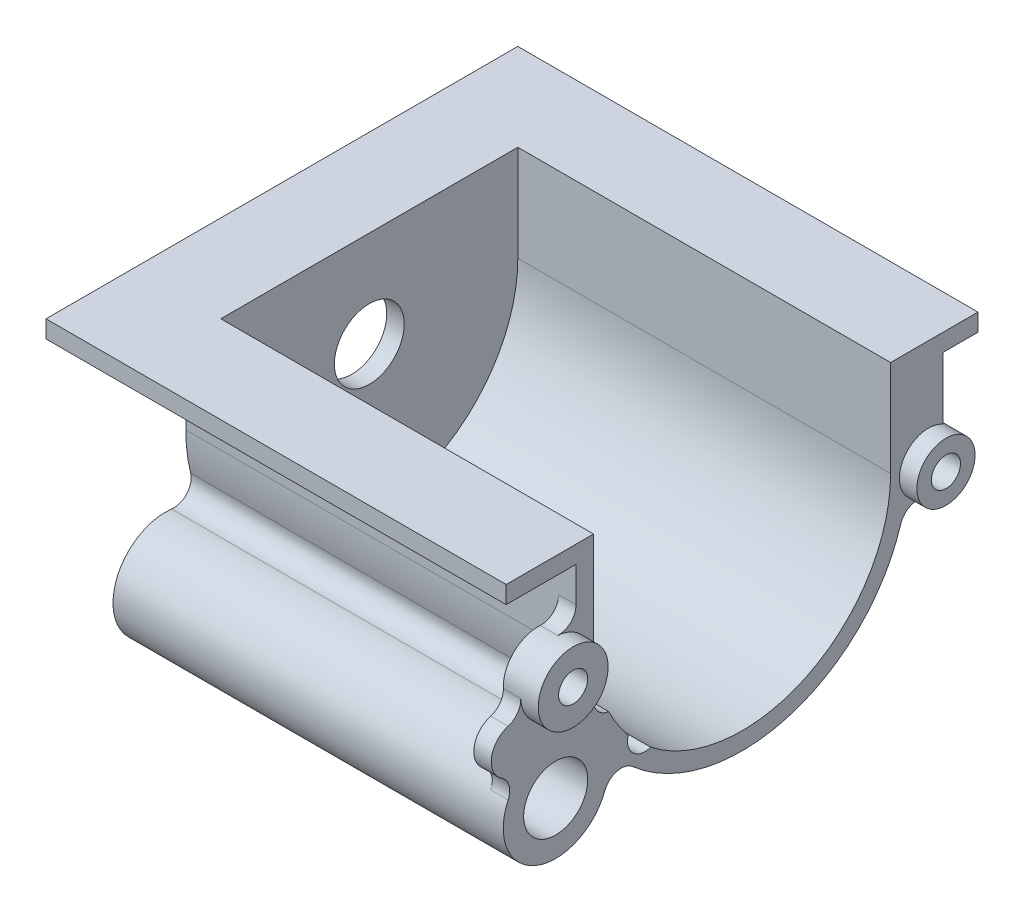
ISO-10303-21;
HEADER;
FILE_DESCRIPTION(('STEP AP214'),'2;1');
FILE_NAME('part.step','',(''),(''),'','','');
FILE_SCHEMA(('AUTOMOTIVE_DESIGN { 1 0 10303 214 1 1 1 1 }'));
ENDSEC;
DATA;
#1=APPLICATION_CONTEXT('core data for automotive mechanical design processes');
#2=APPLICATION_PROTOCOL_DEFINITION('international standard','automotive_design',2000,#1);
#3=PRODUCT_CONTEXT('',#1,'mechanical');
#4=PRODUCT('Part','Part','',(#3));
#5=PRODUCT_RELATED_PRODUCT_CATEGORY('part','',(#4));
#6=PRODUCT_DEFINITION_FORMATION('','',#4);
#7=PRODUCT_DEFINITION_CONTEXT('part definition',#1,'design');
#8=PRODUCT_DEFINITION('design','',#6,#7);
#9=PRODUCT_DEFINITION_SHAPE('','',#8);
#10=(LENGTH_UNIT() NAMED_UNIT(*) SI_UNIT(.MILLI.,.METRE.));
#11=(NAMED_UNIT(*) PLANE_ANGLE_UNIT() SI_UNIT($,.RADIAN.));
#12=(NAMED_UNIT(*) SI_UNIT($,.STERADIAN.) SOLID_ANGLE_UNIT());
#13=UNCERTAINTY_MEASURE_WITH_UNIT(LENGTH_MEASURE(1.E-05),#10,'distance_accuracy_value','');
#14=(GEOMETRIC_REPRESENTATION_CONTEXT(3) GLOBAL_UNCERTAINTY_ASSIGNED_CONTEXT((#13)) GLOBAL_UNIT_ASSIGNED_CONTEXT((#10,
#11,#12)) REPRESENTATION_CONTEXT('',''));
#15=CARTESIAN_POINT('',(0.,0.,0.));
#16=DIRECTION('',(0.,0.,1.));
#17=DIRECTION('',(1.,0.,0.));
#18=AXIS2_PLACEMENT_3D('',#15,#16,#17);
#19=CARTESIAN_POINT('',(67.,0.,0.));
#20=DIRECTION('',(-1.,0.,0.));
#21=DIRECTION('',(0.,0.,1.));
#22=AXIS2_PLACEMENT_3D('',#19,#20,#21);
#23=CYLINDRICAL_SURFACE('',#22,25.5);
#24=DIRECTION('',(1.,0.,0.));
#25=VECTOR('',#24,1.);
#26=CARTESIAN_POINT('',(35.,-16.3842544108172,19.5398620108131));
#27=LINE('',#26,#25);
#28=CARTESIAN_POINT('',(3.,-16.3842544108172,19.5398620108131));
#29=VERTEX_POINT('',#28);
#30=CARTESIAN_POINT('',(67.,-16.3842544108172,19.5398620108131));
#31=VERTEX_POINT('',#30);
#32=EDGE_CURVE('E226',#29,#31,#27,.T.);
#33=ORIENTED_EDGE('',*,*,#32,.F.);
#34=CARTESIAN_POINT('',(3.,0.,0.));
#35=DIRECTION('',(-1.,0.,0.));
#36=DIRECTION('',(0.,0.,1.));
#37=AXIS2_PLACEMENT_3D('',#34,#35,#36);
#38=CIRCLE('',#37,25.5);
#39=CARTESIAN_POINT('',(3.,-11.1864755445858,22.9153390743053));
#40=VERTEX_POINT('',#39);
#41=EDGE_CURVE('E423',#40,#29,#38,.F.);
#42=ORIENTED_EDGE('',*,*,#41,.F.);
#43=DIRECTION('',(1.,0.,0.));
#44=VECTOR('',#43,1.);
#45=CARTESIAN_POINT('',(35.,-11.1864755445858,22.9153390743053));
#46=LINE('',#45,#44);
#47=CARTESIAN_POINT('',(67.,-11.1864755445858,22.9153390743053));
#48=VERTEX_POINT('',#47);
#49=EDGE_CURVE('E245',#48,#40,#46,.F.);
#50=ORIENTED_EDGE('',*,*,#49,.F.);
#51=CARTESIAN_POINT('',(67.,0.,0.));
#52=DIRECTION('',(-1.,0.,0.));
#53=DIRECTION('',(0.,0.,1.));
#54=AXIS2_PLACEMENT_3D('',#51,#52,#53);
#55=CIRCLE('',#54,25.5);
#56=EDGE_CURVE('E240',#48,#31,#55,.F.);
#57=ORIENTED_EDGE('',*,*,#56,.T.);
#58=EDGE_LOOP('',(#33,#42,#50,#57));
#59=FACE_BOUND('',#58,.T.);
#60=ADVANCED_FACE('F29',(#59),#23,.F.);
#61=DIRECTION('',(1.,0.,0.));
#62=VECTOR('',#61,1.);
#63=CARTESIAN_POINT('',(35.,-6.1603585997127,24.7446960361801));
#64=LINE('',#63,#62);
#65=CARTESIAN_POINT('',(3.,-6.1603585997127,24.7446960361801));
#66=VERTEX_POINT('',#65);
#67=CARTESIAN_POINT('',(67.,-6.16035859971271,24.7446960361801));
#68=VERTEX_POINT('',#67);
#69=EDGE_CURVE('E449',#66,#68,#64,.T.);
#70=ORIENTED_EDGE('',*,*,#69,.F.);
#71=CARTESIAN_POINT('',(3.,0.,25.5));
#72=VERTEX_POINT('',#71);
#73=EDGE_CURVE('E420',#72,#66,#38,.F.);
#74=ORIENTED_EDGE('',*,*,#73,.F.);
#75=DIRECTION('',(-1.,0.,0.));
#76=VECTOR('',#75,1.);
#77=CARTESIAN_POINT('',(67.,0.,25.5));
#78=LINE('',#77,#76);
#79=CARTESIAN_POINT('',(67.,0.,25.5));
#80=VERTEX_POINT('',#79);
#81=EDGE_CURVE('E266',#80,#72,#78,.T.);
#82=ORIENTED_EDGE('',*,*,#81,.F.);
#83=EDGE_CURVE('E246',#80,#68,#55,.F.);
#84=ORIENTED_EDGE('',*,*,#83,.T.);
#85=EDGE_LOOP('',(#70,#74,#82,#84));
#86=FACE_BOUND('',#85,.T.);
#87=ADVANCED_FACE('F447',(#86),#23,.F.);
#88=CARTESIAN_POINT('',(67.,0.,0.));
#89=DIRECTION('',(-1.,0.,0.));
#90=DIRECTION('',(0.,0.,1.));
#91=AXIS2_PLACEMENT_3D('',#88,#89,#90);
#92=CYLINDRICAL_SURFACE('',#91,28.5);
#93=DIRECTION('',(-1.,0.,0.));
#94=VECTOR('',#93,1.);
#95=CARTESIAN_POINT('',(67.,-21.4374447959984,18.779935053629));
#96=LINE('',#95,#94);
#97=CARTESIAN_POINT('',(67.,-21.4374447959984,18.779935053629));
#98=VERTEX_POINT('',#97);
#99=CARTESIAN_POINT('',(0.,-21.4374447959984,18.779935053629));
#100=VERTEX_POINT('',#99);
#101=EDGE_CURVE('E303',#98,#100,#96,.T.);
#102=ORIENTED_EDGE('',*,*,#101,.T.);
#103=CARTESIAN_POINT('',(0.,0.,0.));
#104=DIRECTION('',(1.,0.,0.));
#105=DIRECTION('',(0.,0.,1.));
#106=AXIS2_PLACEMENT_3D('',#103,#104,#105);
#107=CIRCLE('',#106,28.5);
#108=CARTESIAN_POINT('',(0.,0.,-28.5));
#109=VERTEX_POINT('',#108);
#110=EDGE_CURVE('E271',#100,#109,#107,.T.);
#111=ORIENTED_EDGE('',*,*,#110,.T.);
#112=DIRECTION('',(-1.,0.,0.));
#113=VECTOR('',#112,1.);
#114=CARTESIAN_POINT('',(67.,0.,-28.5));
#115=LINE('',#114,#113);
#116=CARTESIAN_POINT('',(64.,0.,-28.5));
#117=VERTEX_POINT('',#116);
#118=EDGE_CURVE('E289',#117,#109,#115,.T.);
#119=ORIENTED_EDGE('',*,*,#118,.F.);
#120=CARTESIAN_POINT('',(64.,0.,0.));
#121=DIRECTION('',(1.,0.,0.));
#122=DIRECTION('',(0.,0.,-1.));
#123=AXIS2_PLACEMENT_3D('',#120,#121,#122);
#124=CIRCLE('',#123,28.5);
#125=CARTESIAN_POINT('',(64.,-8.38911689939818,-27.2373405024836));
#126=VERTEX_POINT('',#125);
#127=EDGE_CURVE('E332',#126,#117,#124,.T.);
#128=ORIENTED_EDGE('',*,*,#127,.F.);
#129=DIRECTION('',(-1.,0.,0.));
#130=VECTOR('',#129,1.);
#131=CARTESIAN_POINT('',(67.,-8.38911689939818,-27.2373405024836));
#132=LINE('',#131,#130);
#133=CARTESIAN_POINT('',(67.,-8.38911689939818,-27.2373405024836));
#134=VERTEX_POINT('',#133);
#135=EDGE_CURVE('E300',#126,#134,#132,.F.);
#136=ORIENTED_EDGE('',*,*,#135,.T.);
#137=CARTESIAN_POINT('',(67.,0.,0.));
#138=DIRECTION('',(1.,0.,0.));
#139=DIRECTION('',(0.,0.,1.));
#140=AXIS2_PLACEMENT_3D('',#137,#138,#139);
#141=CIRCLE('',#140,28.5);
#142=EDGE_CURVE('E277',#98,#134,#141,.T.);
#143=ORIENTED_EDGE('',*,*,#142,.F.);
#144=EDGE_LOOP('',(#102,#111,#119,#128,#136,#143));
#145=FACE_BOUND('',#144,.T.);
#146=ADVANCED_FACE('F510',(#145),#92,.T.);
#147=CARTESIAN_POINT('',(64.,-1.85585656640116,40.9929620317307));
#148=DIRECTION('',(1.,0.,0.));
#149=DIRECTION('',(0.,0.,-1.));
#150=AXIS2_PLACEMENT_3D('',#147,#148,#149);
#151=PLANE('',#150);
#152=CARTESIAN_POINT('',(64.,-1.5,32.));
#153=DIRECTION('',(1.,0.,0.));
#154=DIRECTION('',(0.,0.,-1.));
#155=AXIS2_PLACEMENT_3D('',#152,#153,#154);
#156=CIRCLE('',#155,2.49999999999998);
#157=CARTESIAN_POINT('',(64.,-1.5,29.5));
#158=VERTEX_POINT('',#157);
#159=EDGE_CURVE('E529',#158,#158,#156,.T.);
#160=ORIENTED_EDGE('',*,*,#159,.T.);
#161=EDGE_LOOP('',(#160));
#162=FACE_BOUND('',#161,.T.);
#163=CARTESIAN_POINT('',(64.,-19.5,32.));
#164=DIRECTION('',(-1.,0.,0.));
#165=DIRECTION('',(0.,0.,1.));
#166=AXIS2_PLACEMENT_3D('',#163,#164,#165);
#167=CIRCLE('',#166,9.);
#168=CARTESIAN_POINT('',(64.,-15.7094202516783,40.162812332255));
#169=VERTEX_POINT('',#168);
#170=CARTESIAN_POINT('',(64.,-10.5638509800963,30.9298408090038));
#171=VERTEX_POINT('',#170);
#172=EDGE_CURVE('E457',#169,#171,#167,.T.);
#173=ORIENTED_EDGE('',*,*,#172,.F.);
#174=CARTESIAN_POINT('',(64.,-14.4458936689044,42.8837497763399));
#175=DIRECTION('',(-1.,0.,0.));
#176=DIRECTION('',(0.,0.,-1.));
#177=AXIS2_PLACEMENT_3D('',#174,#175,#176);
#178=CIRCLE('',#177,3.);
#179=CARTESIAN_POINT('',(64.,-11.9333678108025,41.2444774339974));
#180=VERTEX_POINT('',#179);
#181=EDGE_CURVE('E361',#180,#169,#178,.T.);
#182=ORIENTED_EDGE('',*,*,#181,.F.);
#183=CARTESIAN_POINT('',(64.,-8.58333333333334,39.0587809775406));
#184=DIRECTION('',(1.,0.,0.));
#185=DIRECTION('',(0.,0.,-1.));
#186=AXIS2_PLACEMENT_3D('',#183,#184,#185);
#187=CIRCLE('',#186,4.);
#188=CARTESIAN_POINT('',(64.,-4.73906089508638,40.1640272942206));
#189=VERTEX_POINT('',#188);
#190=EDGE_CURVE('E358',#189,#180,#187,.T.);
#191=ORIENTED_EDGE('',*,*,#190,.F.);
#192=CARTESIAN_POINT('',(64.,-1.85585656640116,40.9929620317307));
#193=DIRECTION('',(-1.,0.,0.));
#194=DIRECTION('',(0.,0.,-1.));
#195=AXIS2_PLACEMENT_3D('',#192,#193,#194);
#196=CIRCLE('',#195,3.);
#197=CARTESIAN_POINT('',(64.,-1.7372377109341,37.9953080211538));
#198=VERTEX_POINT('',#197);
#199=EDGE_CURVE('E355',#198,#189,#196,.T.);
#200=ORIENTED_EDGE('',*,*,#199,.F.);
#201=CARTESIAN_POINT('',(64.,-1.5,32.));
#202=DIRECTION('',(1.,0.,0.));
#203=DIRECTION('',(0.,0.,-1.));
#204=AXIS2_PLACEMENT_3D('',#201,#202,#203);
#205=CIRCLE('',#204,6.);
#206=CARTESIAN_POINT('',(64.,4.49073358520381,31.6666666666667));
#207=VERTEX_POINT('',#206);
#208=EDGE_CURVE('E368',#207,#198,#205,.T.);
#209=ORIENTED_EDGE('',*,*,#208,.F.);
#210=CARTESIAN_POINT('',(64.,7.48610037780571,31.5));
#211=DIRECTION('',(1.,0.,0.));
#212=DIRECTION('',(0.,0.,-1.));
#213=AXIS2_PLACEMENT_3D('',#210,#211,#212);
#214=CIRCLE('',#213,3.);
#215=CARTESIAN_POINT('',(64.,7.48610037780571,28.5));
#216=VERTEX_POINT('',#215);
#217=EDGE_CURVE('E308',#207,#216,#214,.T.);
#218=ORIENTED_EDGE('',*,*,#217,.T.);
#219=DIRECTION('',(0.,1.,0.));
#220=VECTOR('',#219,1.);
#221=CARTESIAN_POINT('',(64.,3.37339717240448,28.5));
#222=LINE('',#221,#220);
#223=CARTESIAN_POINT('',(64.,0.,28.5));
#224=VERTEX_POINT('',#223);
#225=EDGE_CURVE('E366',#224,#216,#222,.T.);
#226=ORIENTED_EDGE('',*,*,#225,.F.);
#227=CARTESIAN_POINT('',(64.,0.,0.));
#228=DIRECTION('',(-1.,0.,0.));
#229=DIRECTION('',(0.,0.,-1.));
#230=AXIS2_PLACEMENT_3D('',#227,#228,#229);
#231=CIRCLE('',#230,28.5);
#232=CARTESIAN_POINT('',(64.,-6.86274086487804,27.6613952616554));
#233=VERTEX_POINT('',#232);
#234=EDGE_CURVE('E364',#233,#224,#231,.T.);
#235=ORIENTED_EDGE('',*,*,#234,.F.);
#236=CARTESIAN_POINT('',(64.,-7.58513464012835,30.5731210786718));
#237=DIRECTION('',(1.,0.,0.));
#238=DIRECTION('',(0.,0.,-1.));
#239=AXIS2_PLACEMENT_3D('',#236,#237,#238);
#240=CIRCLE('',#239,3.00000000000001);
#241=EDGE_CURVE('E458',#171,#233,#240,.T.);
#242=ORIENTED_EDGE('',*,*,#241,.F.);
#243=EDGE_LOOP('',(#173,#182,#191,#200,#209,#218,#226,#235,#242));
#244=FACE_BOUND('',#243,.T.);
#245=ADVANCED_FACE('F568',(#162,#244),#151,.F.);
#246=CARTESIAN_POINT('',(67.,0.,0.));
#247=DIRECTION('',(-1.,0.,0.));
#248=DIRECTION('',(0.,0.,1.));
#249=AXIS2_PLACEMENT_3D('',#246,#247,#248);
#250=PLANE('',#249);
#251=CARTESIAN_POINT('',(67.,-19.5,32.));
#252=DIRECTION('',(1.,0.,0.));
#253=DIRECTION('',(0.,0.,-1.));
#254=AXIS2_PLACEMENT_3D('',#251,#252,#253);
#255=CIRCLE('',#254,5.49999999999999);
#256=CARTESIAN_POINT('',(67.,-19.5,26.5));
#257=VERTEX_POINT('',#256);
#258=EDGE_CURVE('E535',#257,#257,#255,.T.);
#259=ORIENTED_EDGE('',*,*,#258,.F.);
#260=EDGE_LOOP('',(#259));
#261=FACE_BOUND('',#260,.T.);
#262=CARTESIAN_POINT('',(67.,-20.0997610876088,15.6923422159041));
#263=VERTEX_POINT('',#262);
#264=CARTESIAN_POINT('',(67.,0.,-25.5));
#265=VERTEX_POINT('',#264);
#266=EDGE_CURVE('E242',#263,#265,#55,.F.);
#267=ORIENTED_EDGE('',*,*,#266,.F.);
#268=CARTESIAN_POINT('',(67.,-17.2641552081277,16.6718008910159));
#269=DIRECTION('',(1.,0.,0.));
#270=DIRECTION('',(0.,0.,-1.));
#271=AXIS2_PLACEMENT_3D('',#268,#269,#270);
#272=CIRCLE('',#271,3.);
#273=EDGE_CURVE('E46',#31,#263,#272,.T.);
#274=ORIENTED_EDGE('',*,*,#273,.F.);
#275=ORIENTED_EDGE('',*,*,#56,.F.);
#276=CARTESIAN_POINT('',(67.,-8.20848343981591,22.5526228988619));
#277=DIRECTION('',(1.,0.,0.));
#278=DIRECTION('',(0.,0.,-1.));
#279=AXIS2_PLACEMENT_3D('',#276,#277,#278);
#280=CIRCLE('',#279,3.);
#281=EDGE_CURVE('E54',#68,#48,#280,.T.);
#282=ORIENTED_EDGE('',*,*,#281,.F.);
#283=ORIENTED_EDGE('',*,*,#83,.F.);
#284=DIRECTION('',(0.,-1.,0.));
#285=VECTOR('',#284,1.);
#286=CARTESIAN_POINT('',(67.,0.,25.5));
#287=LINE('',#286,#285);
#288=CARTESIAN_POINT('',(67.,16.5,25.5));
#289=VERTEX_POINT('',#288);
#290=EDGE_CURVE('E255',#289,#80,#287,.T.);
#291=ORIENTED_EDGE('',*,*,#290,.F.);
#292=DIRECTION('',(0.,0.,1.));
#293=VECTOR('',#292,1.);
#294=CARTESIAN_POINT('',(67.,16.5,28.5));
#295=LINE('',#294,#293);
#296=CARTESIAN_POINT('',(67.,16.5,40.5));
#297=VERTEX_POINT('',#296);
#298=EDGE_CURVE('E280',#289,#297,#295,.T.);
#299=ORIENTED_EDGE('',*,*,#298,.T.);
#300=DIRECTION('',(0.,1.,0.));
#301=VECTOR('',#300,1.);
#302=CARTESIAN_POINT('',(67.,13.5,40.5));
#303=LINE('',#302,#301);
#304=CARTESIAN_POINT('',(67.,13.5,40.5));
#305=VERTEX_POINT('',#304);
#306=EDGE_CURVE('E403',#305,#297,#303,.T.);
#307=ORIENTED_EDGE('',*,*,#306,.F.);
#308=DIRECTION('',(0.,0.,-1.));
#309=VECTOR('',#308,1.);
#310=CARTESIAN_POINT('',(67.,13.5,25.5));
#311=LINE('',#310,#309);
#312=CARTESIAN_POINT('',(67.,13.5,28.5));
#313=VERTEX_POINT('',#312);
#314=EDGE_CURVE('E399',#305,#313,#311,.T.);
#315=ORIENTED_EDGE('',*,*,#314,.T.);
#316=DIRECTION('',(0.,-1.,0.));
#317=VECTOR('',#316,1.);
#318=CARTESIAN_POINT('',(67.,0.,28.5));
#319=LINE('',#318,#317);
#320=CARTESIAN_POINT('',(67.,7.48610037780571,28.5));
#321=VERTEX_POINT('',#320);
#322=EDGE_CURVE('E284',#313,#321,#319,.T.);
#323=ORIENTED_EDGE('',*,*,#322,.T.);
#324=CARTESIAN_POINT('',(67.,7.48610037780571,31.5));
#325=DIRECTION('',(-1.,0.,0.));
#326=DIRECTION('',(0.,0.,1.));
#327=AXIS2_PLACEMENT_3D('',#324,#325,#326);
#328=CIRCLE('',#327,3.);
#329=CARTESIAN_POINT('',(67.,4.49073358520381,31.6666666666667));
#330=VERTEX_POINT('',#329);
#331=EDGE_CURVE('E306',#321,#330,#328,.T.);
#332=ORIENTED_EDGE('',*,*,#331,.T.);
#333=CARTESIAN_POINT('',(67.,-1.5,32.));
#334=DIRECTION('',(1.,0.,0.));
#335=DIRECTION('',(0.,0.,-1.));
#336=AXIS2_PLACEMENT_3D('',#333,#334,#335);
#337=CIRCLE('',#336,5.99999999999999);
#338=CARTESIAN_POINT('',(67.,-1.7372377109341,37.9953080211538));
#339=VERTEX_POINT('',#338);
#340=EDGE_CURVE('E468',#339,#330,#337,.T.);
#341=ORIENTED_EDGE('',*,*,#340,.F.);
#342=CARTESIAN_POINT('',(67.,-1.85585656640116,40.9929620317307));
#343=DIRECTION('',(-1.,0.,0.));
#344=DIRECTION('',(0.,0.,-1.));
#345=AXIS2_PLACEMENT_3D('',#342,#343,#344);
#346=CIRCLE('',#345,3.);
#347=CARTESIAN_POINT('',(67.,-4.73906089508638,40.1640272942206));
#348=VERTEX_POINT('',#347);
#349=EDGE_CURVE('E343',#339,#348,#346,.T.);
#350=ORIENTED_EDGE('',*,*,#349,.T.);
#351=CARTESIAN_POINT('',(67.,-8.58333333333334,39.0587809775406));
#352=DIRECTION('',(1.,0.,0.));
#353=DIRECTION('',(0.,0.,-1.));
#354=AXIS2_PLACEMENT_3D('',#351,#352,#353);
#355=CIRCLE('',#354,4.);
#356=CARTESIAN_POINT('',(67.,-11.9333678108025,41.2444774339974));
#357=VERTEX_POINT('',#356);
#358=EDGE_CURVE('E346',#348,#357,#355,.T.);
#359=ORIENTED_EDGE('',*,*,#358,.T.);
#360=CARTESIAN_POINT('',(67.,-14.4458936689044,42.8837497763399));
#361=DIRECTION('',(-1.,0.,0.));
#362=DIRECTION('',(0.,0.,-1.));
#363=AXIS2_PLACEMENT_3D('',#360,#361,#362);
#364=CIRCLE('',#363,3.);
#365=CARTESIAN_POINT('',(67.,-15.7094202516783,40.162812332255));
#366=VERTEX_POINT('',#365);
#367=EDGE_CURVE('E349',#357,#366,#364,.T.);
#368=ORIENTED_EDGE('',*,*,#367,.T.);
#369=CARTESIAN_POINT('',(67.,-19.5,32.));
#370=DIRECTION('',(1.,0.,0.));
#371=DIRECTION('',(0.,0.,-1.));
#372=AXIS2_PLACEMENT_3D('',#369,#370,#371);
#373=CIRCLE('',#372,9.);
#374=CARTESIAN_POINT('',(67.,-22.6455134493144,23.567577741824));
#375=VERTEX_POINT('',#374);
#376=EDGE_CURVE('E352',#366,#375,#373,.T.);
#377=ORIENTED_EDGE('',*,*,#376,.T.);
#378=CARTESIAN_POINT('',(67.,-23.6940179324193,20.756770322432));
#379=DIRECTION('',(-1.,0.,0.));
#380=DIRECTION('',(0.,0.,1.));
#381=AXIS2_PLACEMENT_3D('',#378,#379,#380);
#382=CIRCLE('',#381,3.);
#383=EDGE_CURVE('E311',#375,#98,#382,.T.);
#384=ORIENTED_EDGE('',*,*,#383,.T.);
#385=ORIENTED_EDGE('',*,*,#142,.T.);
#386=CARTESIAN_POINT('',(67.,-9.27218183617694,-30.1044289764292));
#387=DIRECTION('',(-1.,0.,0.));
#388=DIRECTION('',(0.,0.,1.));
#389=AXIS2_PLACEMENT_3D('',#386,#387,#388);
#390=CIRCLE('',#389,3.);
#391=CARTESIAN_POINT('',(67.,-6.35761364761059,-30.8152681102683));
#392=VERTEX_POINT('',#391);
#393=EDGE_CURVE('E38',#134,#392,#390,.T.);
#394=ORIENTED_EDGE('',*,*,#393,.T.);
#395=CARTESIAN_POINT('',(67.,-1.5,-32.));
#396=DIRECTION('',(1.,0.,0.));
#397=DIRECTION('',(0.,0.,-1.));
#398=AXIS2_PLACEMENT_3D('',#395,#396,#397);
#399=CIRCLE('',#398,5.);
#400=CARTESIAN_POINT('',(67.,2.83012701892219,-34.5));
#401=VERTEX_POINT('',#400);
#402=EDGE_CURVE('E318',#401,#392,#399,.T.);
#403=ORIENTED_EDGE('',*,*,#402,.F.);
#404=DIRECTION('',(0.,1.,0.));
#405=VECTOR('',#404,1.);
#406=CARTESIAN_POINT('',(67.,2.83012701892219,-34.5));
#407=LINE('',#406,#405);
#408=CARTESIAN_POINT('',(67.,13.5,-34.5));
#409=VERTEX_POINT('',#408);
#410=EDGE_CURVE('E315',#401,#409,#407,.T.);
#411=ORIENTED_EDGE('',*,*,#410,.T.);
#412=DIRECTION('',(0.,0.,-1.));
#413=VECTOR('',#412,1.);
#414=CARTESIAN_POINT('',(67.,13.5,-25.5));
#415=LINE('',#414,#413);
#416=CARTESIAN_POINT('',(67.,13.5,-40.5));
#417=VERTEX_POINT('',#416);
#418=EDGE_CURVE('E388',#409,#417,#415,.T.);
#419=ORIENTED_EDGE('',*,*,#418,.T.);
#420=DIRECTION('',(0.,1.,0.));
#421=VECTOR('',#420,1.);
#422=CARTESIAN_POINT('',(67.,13.5,-40.5));
#423=LINE('',#422,#421);
#424=CARTESIAN_POINT('',(67.,16.5,-40.5));
#425=VERTEX_POINT('',#424);
#426=EDGE_CURVE('E402',#417,#425,#423,.T.);
#427=ORIENTED_EDGE('',*,*,#426,.T.);
#428=CARTESIAN_POINT('',(67.,16.5,-25.5));
#429=VERTEX_POINT('',#428);
#430=EDGE_CURVE('E281',#425,#429,#295,.T.);
#431=ORIENTED_EDGE('',*,*,#430,.T.);
#432=DIRECTION('',(0.,1.,0.));
#433=VECTOR('',#432,1.);
#434=CARTESIAN_POINT('',(67.,0.,-25.5));
#435=LINE('',#434,#433);
#436=EDGE_CURVE('E249',#265,#429,#435,.T.);
#437=ORIENTED_EDGE('',*,*,#436,.F.);
#438=EDGE_LOOP('',(#267,#274,#275,#282,#283,#291,#299,#307,#315,#323,#332,#341,#350,#359,#368,
#377,#384,#385,#394,#403,#411,#419,#427,#431,#437));
#439=FACE_BOUND('',#438,.T.);
#440=ADVANCED_FACE('F239',(#261,#439),#250,.F.);
#441=CARTESIAN_POINT('',(67.,0.,-28.5));
#442=DIRECTION('',(0.,0.,1.));
#443=DIRECTION('',(1.,0.,0.));
#444=AXIS2_PLACEMENT_3D('',#441,#442,#443);
#445=PLANE('',#444);
#446=DIRECTION('',(0.,1.,0.));
#447=VECTOR('',#446,1.);
#448=CARTESIAN_POINT('',(64.,0.,-28.5));
#449=LINE('',#448,#447);
#450=CARTESIAN_POINT('',(64.,13.5,-28.5));
#451=VERTEX_POINT('',#450);
#452=EDGE_CURVE('E328',#117,#451,#449,.T.);
#453=ORIENTED_EDGE('',*,*,#452,.F.);
#454=ORIENTED_EDGE('',*,*,#118,.T.);
#455=DIRECTION('',(0.,1.,0.));
#456=VECTOR('',#455,1.);
#457=CARTESIAN_POINT('',(0.,0.,-28.5));
#458=LINE('',#457,#456);
#459=CARTESIAN_POINT('',(0.,13.5,-28.5));
#460=VERTEX_POINT('',#459);
#461=EDGE_CURVE('E270',#109,#460,#458,.T.);
#462=ORIENTED_EDGE('',*,*,#461,.T.);
#463=DIRECTION('',(-1.,0.,0.));
#464=VECTOR('',#463,1.);
#465=CARTESIAN_POINT('',(67.,13.5,-28.5));
#466=LINE('',#465,#464);
#467=EDGE_CURVE('E417',#451,#460,#466,.T.);
#468=ORIENTED_EDGE('',*,*,#467,.F.);
#469=EDGE_LOOP('',(#453,#454,#462,#468));
#470=FACE_BOUND('',#469,.T.);
#471=ADVANCED_FACE('F567',(#470),#445,.F.);
#472=CARTESIAN_POINT('',(67.,0.,28.5));
#473=DIRECTION('',(0.,0.,-1.));
#474=DIRECTION('',(-1.,0.,0.));
#475=AXIS2_PLACEMENT_3D('',#472,#473,#474);
#476=PLANE('',#475);
#477=ORIENTED_EDGE('',*,*,#225,.T.);
#478=DIRECTION('',(1.,0.,0.));
#479=VECTOR('',#478,1.);
#480=CARTESIAN_POINT('',(67.,7.48610037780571,28.5));
#481=LINE('',#480,#479);
#482=EDGE_CURVE('E292',#216,#321,#481,.T.);
#483=ORIENTED_EDGE('',*,*,#482,.T.);
#484=ORIENTED_EDGE('',*,*,#322,.F.);
#485=DIRECTION('',(1.,0.,0.));
#486=VECTOR('',#485,1.);
#487=CARTESIAN_POINT('',(67.,13.5,28.5));
#488=LINE('',#487,#486);
#489=CARTESIAN_POINT('',(0.,13.5,28.5));
#490=VERTEX_POINT('',#489);
#491=EDGE_CURVE('E415',#490,#313,#488,.T.);
#492=ORIENTED_EDGE('',*,*,#491,.F.);
#493=DIRECTION('',(0.,-1.,0.));
#494=VECTOR('',#493,1.);
#495=CARTESIAN_POINT('',(0.,0.,28.5));
#496=LINE('',#495,#494);
#497=CARTESIAN_POINT('',(0.,0.,28.5));
#498=VERTEX_POINT('',#497);
#499=EDGE_CURVE('E274',#490,#498,#496,.T.);
#500=ORIENTED_EDGE('',*,*,#499,.T.);
#501=DIRECTION('',(-1.,0.,0.));
#502=VECTOR('',#501,1.);
#503=CARTESIAN_POINT('',(67.,0.,28.5));
#504=LINE('',#503,#502);
#505=EDGE_CURVE('E287',#224,#498,#504,.T.);
#506=ORIENTED_EDGE('',*,*,#505,.F.);
#507=EDGE_LOOP('',(#477,#483,#484,#492,#500,#506));
#508=FACE_BOUND('',#507,.T.);
#509=ADVANCED_FACE('F563',(#508),#476,.F.);
#510=CARTESIAN_POINT('',(0.,0.,0.));
#511=DIRECTION('',(-1.,0.,0.));
#512=DIRECTION('',(0.,0.,1.));
#513=AXIS2_PLACEMENT_3D('',#510,#511,#512);
#514=PLANE('',#513);
#515=CARTESIAN_POINT('',(0.,0.,0.));
#516=DIRECTION('',(-1.,0.,0.));
#517=DIRECTION('',(0.,0.,1.));
#518=AXIS2_PLACEMENT_3D('',#515,#516,#517);
#519=CIRCLE('',#518,5.99999999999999);
#520=CARTESIAN_POINT('',(0.,0.,5.99999999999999));
#521=VERTEX_POINT('',#520);
#522=EDGE_CURVE('E538',#521,#521,#519,.T.);
#523=ORIENTED_EDGE('',*,*,#522,.F.);
#524=EDGE_LOOP('',(#523));
#525=FACE_BOUND('',#524,.T.);
#526=CARTESIAN_POINT('',(0.,-19.5,32.));
#527=DIRECTION('',(-1.,0.,0.));
#528=DIRECTION('',(0.,0.,1.));
#529=AXIS2_PLACEMENT_3D('',#526,#527,#528);
#530=CIRCLE('',#529,5.49999999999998);
#531=CARTESIAN_POINT('',(0.,-19.5,37.5));
#532=VERTEX_POINT('',#531);
#533=EDGE_CURVE('E33',#532,#532,#530,.T.);
#534=ORIENTED_EDGE('',*,*,#533,.F.);
#535=EDGE_LOOP('',(#534));
#536=FACE_BOUND('',#535,.T.);
#537=ORIENTED_EDGE('',*,*,#499,.F.);
#538=DIRECTION('',(0.,0.,-1.));
#539=VECTOR('',#538,1.);
#540=CARTESIAN_POINT('',(0.,13.5,0.));
#541=LINE('',#540,#539);
#542=EDGE_CURVE('E406',#490,#460,#541,.T.);
#543=ORIENTED_EDGE('',*,*,#542,.T.);
#544=ORIENTED_EDGE('',*,*,#461,.F.);
#545=ORIENTED_EDGE('',*,*,#110,.F.);
#546=CARTESIAN_POINT('',(0.,-23.6940179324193,20.756770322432));
#547=DIRECTION('',(-1.,0.,0.));
#548=DIRECTION('',(0.,0.,1.));
#549=AXIS2_PLACEMENT_3D('',#546,#547,#548);
#550=CIRCLE('',#549,3.);
#551=CARTESIAN_POINT('',(0.,-22.6455134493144,23.567577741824));
#552=VERTEX_POINT('',#551);
#553=EDGE_CURVE('E472',#100,#552,#550,.F.);
#554=ORIENTED_EDGE('',*,*,#553,.T.);
#555=CARTESIAN_POINT('',(0.,-19.5,32.));
#556=DIRECTION('',(-1.,0.,0.));
#557=DIRECTION('',(0.,0.,1.));
#558=AXIS2_PLACEMENT_3D('',#555,#556,#557);
#559=CIRCLE('',#558,9.);
#560=CARTESIAN_POINT('',(0.,-10.5638509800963,30.9298408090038));
#561=VERTEX_POINT('',#560);
#562=EDGE_CURVE('E469',#552,#561,#559,.T.);
#563=ORIENTED_EDGE('',*,*,#562,.T.);
#564=CARTESIAN_POINT('',(0.,-7.58513464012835,30.5731210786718));
#565=DIRECTION('',(-1.,0.,0.));
#566=DIRECTION('',(0.,0.,1.));
#567=AXIS2_PLACEMENT_3D('',#564,#565,#566);
#568=CIRCLE('',#567,3.00000000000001);
#569=CARTESIAN_POINT('',(0.,-6.86274086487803,27.6613952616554));
#570=VERTEX_POINT('',#569);
#571=EDGE_CURVE('E465',#561,#570,#568,.F.);
#572=ORIENTED_EDGE('',*,*,#571,.T.);
#573=EDGE_CURVE('E268',#498,#570,#107,.T.);
#574=ORIENTED_EDGE('',*,*,#573,.F.);
#575=EDGE_LOOP('',(#537,#543,#544,#545,#554,#563,#572,#574));
#576=FACE_BOUND('',#575,.T.);
#577=ADVANCED_FACE('F561',(#525,#536,#576),#514,.T.);
#578=ORIENTED_EDGE('',*,*,#573,.T.);
#579=DIRECTION('',(1.,0.,0.));
#580=VECTOR('',#579,1.);
#581=CARTESIAN_POINT('',(-31.0145493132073,-6.86274086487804,27.6613952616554));
#582=LINE('',#581,#580);
#583=EDGE_CURVE('E461',#570,#233,#582,.T.);
#584=ORIENTED_EDGE('',*,*,#583,.T.);
#585=ORIENTED_EDGE('',*,*,#234,.T.);
#586=ORIENTED_EDGE('',*,*,#505,.T.);
#587=EDGE_LOOP('',(#578,#584,#585,#586));
#588=FACE_BOUND('',#587,.T.);
#589=ADVANCED_FACE('F31',(#588),#92,.T.);
#590=CARTESIAN_POINT('',(67.,16.5,28.5));
#591=DIRECTION('',(0.,-1.,0.));
#592=DIRECTION('',(0.,0.,-1.));
#593=AXIS2_PLACEMENT_3D('',#590,#591,#592);
#594=PLANE('',#593);
#595=ORIENTED_EDGE('',*,*,#298,.F.);
#596=DIRECTION('',(-1.,0.,0.));
#597=VECTOR('',#596,1.);
#598=CARTESIAN_POINT('',(67.,16.5,25.5));
#599=LINE('',#598,#597);
#600=CARTESIAN_POINT('',(3.,16.5,25.5));
#601=VERTEX_POINT('',#600);
#602=EDGE_CURVE('E260',#289,#601,#599,.T.);
#603=ORIENTED_EDGE('',*,*,#602,.T.);
#604=DIRECTION('',(0.,0.,1.));
#605=VECTOR('',#604,1.);
#606=CARTESIAN_POINT('',(3.,16.5,0.));
#607=LINE('',#606,#605);
#608=CARTESIAN_POINT('',(3.,16.5,-25.5));
#609=VERTEX_POINT('',#608);
#610=EDGE_CURVE('E261',#609,#601,#607,.T.);
#611=ORIENTED_EDGE('',*,*,#610,.F.);
#612=DIRECTION('',(-1.,0.,0.));
#613=VECTOR('',#612,1.);
#614=CARTESIAN_POINT('',(67.,16.5,-25.5));
#615=LINE('',#614,#613);
#616=EDGE_CURVE('E256',#429,#609,#615,.T.);
#617=ORIENTED_EDGE('',*,*,#616,.F.);
#618=ORIENTED_EDGE('',*,*,#430,.F.);
#619=DIRECTION('',(-1.,0.,0.));
#620=VECTOR('',#619,1.);
#621=CARTESIAN_POINT('',(67.,16.5,-40.5));
#622=LINE('',#621,#620);
#623=CARTESIAN_POINT('',(-12.,16.5,-40.5));
#624=VERTEX_POINT('',#623);
#625=EDGE_CURVE('E374',#425,#624,#622,.T.);
#626=ORIENTED_EDGE('',*,*,#625,.T.);
#627=DIRECTION('',(0.,0.,1.));
#628=VECTOR('',#627,1.);
#629=CARTESIAN_POINT('',(-12.,16.5,-40.5));
#630=LINE('',#629,#628);
#631=CARTESIAN_POINT('',(-12.,16.5,40.5));
#632=VERTEX_POINT('',#631);
#633=EDGE_CURVE('E382',#624,#632,#630,.T.);
#634=ORIENTED_EDGE('',*,*,#633,.T.);
#635=DIRECTION('',(1.,0.,0.));
#636=VECTOR('',#635,1.);
#637=CARTESIAN_POINT('',(-12.,16.5,40.5));
#638=LINE('',#637,#636);
#639=EDGE_CURVE('E385',#632,#297,#638,.T.);
#640=ORIENTED_EDGE('',*,*,#639,.T.);
#641=EDGE_LOOP('',(#595,#603,#611,#617,#618,#626,#634,#640));
#642=FACE_BOUND('',#641,.T.);
#643=ADVANCED_FACE('F439',(#642),#594,.F.);
#644=DIRECTION('',(1.,0.,0.));
#645=VECTOR('',#644,1.);
#646=CARTESIAN_POINT('',(35.,-20.0997610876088,15.6923422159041));
#647=LINE('',#646,#645);
#648=CARTESIAN_POINT('',(3.,-20.0997610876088,15.6923422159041));
#649=VERTEX_POINT('',#648);
#650=EDGE_CURVE('E234',#263,#649,#647,.F.);
#651=ORIENTED_EDGE('',*,*,#650,.F.);
#652=ORIENTED_EDGE('',*,*,#266,.T.);
#653=DIRECTION('',(1.,0.,0.));
#654=VECTOR('',#653,1.);
#655=CARTESIAN_POINT('',(67.,0.,-25.5));
#656=LINE('',#655,#654);
#657=CARTESIAN_POINT('',(3.,0.,-25.5));
#658=VERTEX_POINT('',#657);
#659=EDGE_CURVE('E259',#265,#658,#656,.F.);
#660=ORIENTED_EDGE('',*,*,#659,.T.);
#661=EDGE_CURVE('E419',#649,#658,#38,.F.);
#662=ORIENTED_EDGE('',*,*,#661,.F.);
#663=EDGE_LOOP('',(#651,#652,#660,#662));
#664=FACE_BOUND('',#663,.T.);
#665=ADVANCED_FACE('F505',(#664),#23,.F.);
#666=CARTESIAN_POINT('',(67.,0.,-25.5));
#667=DIRECTION('',(0.,0.,1.));
#668=DIRECTION('',(1.,0.,0.));
#669=AXIS2_PLACEMENT_3D('',#666,#667,#668);
#670=PLANE('',#669);
#671=ORIENTED_EDGE('',*,*,#616,.T.);
#672=DIRECTION('',(0.,1.,0.));
#673=VECTOR('',#672,1.);
#674=CARTESIAN_POINT('',(3.,0.,-25.5));
#675=LINE('',#674,#673);
#676=EDGE_CURVE('E263',#658,#609,#675,.T.);
#677=ORIENTED_EDGE('',*,*,#676,.F.);
#678=ORIENTED_EDGE('',*,*,#659,.F.);
#679=ORIENTED_EDGE('',*,*,#436,.T.);
#680=EDGE_LOOP('',(#671,#677,#678,#679));
#681=FACE_BOUND('',#680,.T.);
#682=ADVANCED_FACE('F436',(#681),#670,.T.);
#683=CARTESIAN_POINT('',(67.,0.,25.5));
#684=DIRECTION('',(0.,0.,-1.));
#685=DIRECTION('',(-1.,0.,0.));
#686=AXIS2_PLACEMENT_3D('',#683,#684,#685);
#687=PLANE('',#686);
#688=ORIENTED_EDGE('',*,*,#290,.T.);
#689=ORIENTED_EDGE('',*,*,#81,.T.);
#690=DIRECTION('',(0.,-1.,0.));
#691=VECTOR('',#690,1.);
#692=CARTESIAN_POINT('',(3.,0.,25.5));
#693=LINE('',#692,#691);
#694=EDGE_CURVE('E250',#601,#72,#693,.T.);
#695=ORIENTED_EDGE('',*,*,#694,.F.);
#696=ORIENTED_EDGE('',*,*,#602,.F.);
#697=EDGE_LOOP('',(#688,#689,#695,#696));
#698=FACE_BOUND('',#697,.T.);
#699=ADVANCED_FACE('F442',(#698),#687,.T.);
#700=CARTESIAN_POINT('',(3.,0.,0.));
#701=DIRECTION('',(-1.,0.,0.));
#702=DIRECTION('',(0.,0.,1.));
#703=AXIS2_PLACEMENT_3D('',#700,#701,#702);
#704=PLANE('',#703);
#705=CARTESIAN_POINT('',(3.,0.,0.));
#706=DIRECTION('',(1.,0.,0.));
#707=DIRECTION('',(0.,0.,-1.));
#708=AXIS2_PLACEMENT_3D('',#705,#706,#707);
#709=CIRCLE('',#708,5.99999999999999);
#710=CARTESIAN_POINT('',(3.,0.,-5.99999999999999));
#711=VERTEX_POINT('',#710);
#712=EDGE_CURVE('E541',#711,#711,#709,.T.);
#713=ORIENTED_EDGE('',*,*,#712,.F.);
#714=EDGE_LOOP('',(#713));
#715=FACE_BOUND('',#714,.T.);
#716=ORIENTED_EDGE('',*,*,#41,.T.);
#717=CARTESIAN_POINT('',(3.,-17.2641552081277,16.6718008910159));
#718=DIRECTION('',(-1.,0.,0.));
#719=DIRECTION('',(0.,0.,1.));
#720=AXIS2_PLACEMENT_3D('',#717,#718,#719);
#721=CIRCLE('',#720,3.);
#722=EDGE_CURVE('E229',#29,#649,#721,.F.);
#723=ORIENTED_EDGE('',*,*,#722,.T.);
#724=ORIENTED_EDGE('',*,*,#661,.T.);
#725=ORIENTED_EDGE('',*,*,#676,.T.);
#726=ORIENTED_EDGE('',*,*,#610,.T.);
#727=ORIENTED_EDGE('',*,*,#694,.T.);
#728=ORIENTED_EDGE('',*,*,#73,.T.);
#729=CARTESIAN_POINT('',(3.,-8.20848343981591,22.5526228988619));
#730=DIRECTION('',(-1.,0.,0.));
#731=DIRECTION('',(0.,0.,1.));
#732=AXIS2_PLACEMENT_3D('',#729,#730,#731);
#733=CIRCLE('',#732,3.);
#734=EDGE_CURVE('E451',#66,#40,#733,.F.);
#735=ORIENTED_EDGE('',*,*,#734,.T.);
#736=EDGE_LOOP('',(#716,#723,#724,#725,#726,#727,#728,#735));
#737=FACE_BOUND('',#736,.T.);
#738=ADVANCED_FACE('F429',(#715,#737),#704,.F.);
#739=CARTESIAN_POINT('',(67.,13.5,-25.5));
#740=DIRECTION('',(0.,1.,0.));
#741=DIRECTION('',(0.,0.,1.));
#742=AXIS2_PLACEMENT_3D('',#739,#740,#741);
#743=PLANE('',#742);
#744=ORIENTED_EDGE('',*,*,#418,.F.);
#745=DIRECTION('',(1.,0.,0.));
#746=VECTOR('',#745,1.);
#747=CARTESIAN_POINT('',(42.1164126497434,13.5,-34.5));
#748=LINE('',#747,#746);
#749=CARTESIAN_POINT('',(64.,13.5,-34.5));
#750=VERTEX_POINT('',#749);
#751=EDGE_CURVE('E329',#750,#409,#748,.T.);
#752=ORIENTED_EDGE('',*,*,#751,.F.);
#753=DIRECTION('',(0.,0.,-1.));
#754=VECTOR('',#753,1.);
#755=CARTESIAN_POINT('',(64.,13.5,-34.5));
#756=LINE('',#755,#754);
#757=EDGE_CURVE('E325',#451,#750,#756,.T.);
#758=ORIENTED_EDGE('',*,*,#757,.F.);
#759=ORIENTED_EDGE('',*,*,#467,.T.);
#760=ORIENTED_EDGE('',*,*,#542,.F.);
#761=ORIENTED_EDGE('',*,*,#491,.T.);
#762=ORIENTED_EDGE('',*,*,#314,.F.);
#763=DIRECTION('',(1.,0.,0.));
#764=VECTOR('',#763,1.);
#765=CARTESIAN_POINT('',(-12.,13.5,40.5));
#766=LINE('',#765,#764);
#767=CARTESIAN_POINT('',(-12.,13.5,40.5));
#768=VERTEX_POINT('',#767);
#769=EDGE_CURVE('E396',#768,#305,#766,.T.);
#770=ORIENTED_EDGE('',*,*,#769,.F.);
#771=DIRECTION('',(0.,0.,1.));
#772=VECTOR('',#771,1.);
#773=CARTESIAN_POINT('',(-12.,13.5,-40.5));
#774=LINE('',#773,#772);
#775=CARTESIAN_POINT('',(-12.,13.5,-40.5));
#776=VERTEX_POINT('',#775);
#777=EDGE_CURVE('E393',#776,#768,#774,.T.);
#778=ORIENTED_EDGE('',*,*,#777,.F.);
#779=DIRECTION('',(-1.,0.,0.));
#780=VECTOR('',#779,1.);
#781=CARTESIAN_POINT('',(67.,13.5,-40.5));
#782=LINE('',#781,#780);
#783=EDGE_CURVE('E390',#417,#776,#782,.T.);
#784=ORIENTED_EDGE('',*,*,#783,.F.);
#785=EDGE_LOOP('',(#744,#752,#758,#759,#760,#761,#762,#770,#778,#784));
#786=FACE_BOUND('',#785,.T.);
#787=ADVANCED_FACE('F548',(#786),#743,.F.);
#788=CARTESIAN_POINT('',(-12.,13.5,40.5));
#789=DIRECTION('',(0.,0.,1.));
#790=DIRECTION('',(1.,0.,0.));
#791=AXIS2_PLACEMENT_3D('',#788,#789,#790);
#792=PLANE('',#791);
#793=ORIENTED_EDGE('',*,*,#639,.F.);
#794=DIRECTION('',(0.,1.,0.));
#795=VECTOR('',#794,1.);
#796=CARTESIAN_POINT('',(-12.,13.5,40.5));
#797=LINE('',#796,#795);
#798=EDGE_CURVE('E407',#768,#632,#797,.T.);
#799=ORIENTED_EDGE('',*,*,#798,.F.);
#800=ORIENTED_EDGE('',*,*,#769,.T.);
#801=ORIENTED_EDGE('',*,*,#306,.T.);
#802=EDGE_LOOP('',(#793,#799,#800,#801));
#803=FACE_BOUND('',#802,.T.);
#804=ADVANCED_FACE('F555',(#803),#792,.T.);
#805=CARTESIAN_POINT('',(-12.,13.5,-40.5));
#806=DIRECTION('',(-1.,0.,0.));
#807=DIRECTION('',(0.,0.,1.));
#808=AXIS2_PLACEMENT_3D('',#805,#806,#807);
#809=PLANE('',#808);
#810=ORIENTED_EDGE('',*,*,#633,.F.);
#811=DIRECTION('',(0.,1.,0.));
#812=VECTOR('',#811,1.);
#813=CARTESIAN_POINT('',(-12.,13.5,-40.5));
#814=LINE('',#813,#812);
#815=EDGE_CURVE('E409',#776,#624,#814,.T.);
#816=ORIENTED_EDGE('',*,*,#815,.F.);
#817=ORIENTED_EDGE('',*,*,#777,.T.);
#818=ORIENTED_EDGE('',*,*,#798,.T.);
#819=EDGE_LOOP('',(#810,#816,#817,#818));
#820=FACE_BOUND('',#819,.T.);
#821=ADVANCED_FACE('F615',(#820),#809,.T.);
#822=CARTESIAN_POINT('',(67.,13.5,-40.5));
#823=DIRECTION('',(0.,0.,-1.));
#824=DIRECTION('',(-1.,0.,0.));
#825=AXIS2_PLACEMENT_3D('',#822,#823,#824);
#826=PLANE('',#825);
#827=ORIENTED_EDGE('',*,*,#625,.F.);
#828=ORIENTED_EDGE('',*,*,#426,.F.);
#829=ORIENTED_EDGE('',*,*,#783,.T.);
#830=ORIENTED_EDGE('',*,*,#815,.T.);
#831=EDGE_LOOP('',(#827,#828,#829,#830));
#832=FACE_BOUND('',#831,.T.);
#833=ADVANCED_FACE('F499',(#832),#826,.T.);
#834=CARTESIAN_POINT('',(64.,-1.85585656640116,40.9929620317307));
#835=DIRECTION('',(1.,0.,0.));
#836=DIRECTION('',(0.,0.,-1.));
#837=AXIS2_PLACEMENT_3D('',#834,#835,#836);
#838=CYLINDRICAL_SURFACE('',#837,3.);
#839=ORIENTED_EDGE('',*,*,#349,.F.);
#840=DIRECTION('',(1.,0.,0.));
#841=VECTOR('',#840,1.);
#842=CARTESIAN_POINT('',(64.,-1.7372377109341,37.9953080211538));
#843=LINE('',#842,#841);
#844=EDGE_CURVE('E371',#198,#339,#843,.T.);
#845=ORIENTED_EDGE('',*,*,#844,.F.);
#846=ORIENTED_EDGE('',*,*,#199,.T.);
#847=DIRECTION('',(1.,0.,0.));
#848=VECTOR('',#847,1.);
#849=CARTESIAN_POINT('',(64.,-4.73906089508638,40.1640272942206));
#850=LINE('',#849,#848);
#851=EDGE_CURVE('E370',#189,#348,#850,.T.);
#852=ORIENTED_EDGE('',*,*,#851,.T.);
#853=EDGE_LOOP('',(#839,#845,#846,#852));
#854=FACE_BOUND('',#853,.T.);
#855=ADVANCED_FACE('F487',(#854),#838,.F.);
#856=CARTESIAN_POINT('',(64.,-1.5,32.));
#857=DIRECTION('',(1.,0.,0.));
#858=DIRECTION('',(0.,0.,-1.));
#859=AXIS2_PLACEMENT_3D('',#856,#857,#858);
#860=CYLINDRICAL_SURFACE('',#859,6.);
#861=ORIENTED_EDGE('',*,*,#844,.T.);
#862=ORIENTED_EDGE('',*,*,#340,.T.);
#863=DIRECTION('',(1.,0.,0.));
#864=VECTOR('',#863,1.);
#865=CARTESIAN_POINT('',(64.,4.49073358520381,31.6666666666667));
#866=LINE('',#865,#864);
#867=EDGE_CURVE('E295',#330,#207,#866,.F.);
#868=ORIENTED_EDGE('',*,*,#867,.T.);
#869=ORIENTED_EDGE('',*,*,#208,.T.);
#870=EDGE_LOOP('',(#861,#862,#868,#869));
#871=FACE_BOUND('',#870,.T.);
#872=CARTESIAN_POINT('',(70.,-1.5,32.));
#873=DIRECTION('',(1.,0.,0.));
#874=DIRECTION('',(0.,0.,-1.));
#875=AXIS2_PLACEMENT_3D('',#872,#873,#874);
#876=CIRCLE('',#875,5.99999999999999);
#877=CARTESIAN_POINT('',(70.,-1.5,26.));
#878=VERTEX_POINT('',#877);
#879=EDGE_CURVE('E323',#878,#878,#876,.T.);
#880=ORIENTED_EDGE('',*,*,#879,.F.);
#881=EDGE_LOOP('',(#880));
#882=FACE_BOUND('',#881,.T.);
#883=ADVANCED_FACE('F484',(#871,#882),#860,.T.);
#884=CARTESIAN_POINT('',(64.,-19.5,32.));
#885=DIRECTION('',(1.,0.,0.));
#886=DIRECTION('',(0.,0.,-1.));
#887=AXIS2_PLACEMENT_3D('',#884,#885,#886);
#888=CYLINDRICAL_SURFACE('',#887,9.);
#889=DIRECTION('',(1.,0.,0.));
#890=VECTOR('',#889,1.);
#891=CARTESIAN_POINT('',(64.,-15.7094202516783,40.162812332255));
#892=LINE('',#891,#890);
#893=EDGE_CURVE('E375',#169,#366,#892,.T.);
#894=ORIENTED_EDGE('',*,*,#893,.F.);
#895=ORIENTED_EDGE('',*,*,#172,.T.);
#896=DIRECTION('',(1.,0.,0.));
#897=VECTOR('',#896,1.);
#898=CARTESIAN_POINT('',(-31.0145493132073,-10.5638509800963,30.9298408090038));
#899=LINE('',#898,#897);
#900=EDGE_CURVE('E462',#561,#171,#899,.T.);
#901=ORIENTED_EDGE('',*,*,#900,.F.);
#902=ORIENTED_EDGE('',*,*,#562,.F.);
#903=DIRECTION('',(1.,0.,0.));
#904=VECTOR('',#903,1.);
#905=CARTESIAN_POINT('',(64.,-22.6455134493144,23.567577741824));
#906=LINE('',#905,#904);
#907=EDGE_CURVE('E297',#552,#375,#906,.T.);
#908=ORIENTED_EDGE('',*,*,#907,.T.);
#909=ORIENTED_EDGE('',*,*,#376,.F.);
#910=EDGE_LOOP('',(#894,#895,#901,#902,#908,#909));
#911=FACE_BOUND('',#910,.T.);
#912=ADVANCED_FACE('F486',(#911),#888,.T.);
#913=CARTESIAN_POINT('',(64.,-14.4458936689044,42.8837497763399));
#914=DIRECTION('',(1.,0.,0.));
#915=DIRECTION('',(0.,0.,-1.));
#916=AXIS2_PLACEMENT_3D('',#913,#914,#915);
#917=CYLINDRICAL_SURFACE('',#916,3.);
#918=ORIENTED_EDGE('',*,*,#367,.F.);
#919=DIRECTION('',(1.,0.,0.));
#920=VECTOR('',#919,1.);
#921=CARTESIAN_POINT('',(64.,-11.9333678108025,41.2444774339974));
#922=LINE('',#921,#920);
#923=EDGE_CURVE('E377',#180,#357,#922,.T.);
#924=ORIENTED_EDGE('',*,*,#923,.F.);
#925=ORIENTED_EDGE('',*,*,#181,.T.);
#926=ORIENTED_EDGE('',*,*,#893,.T.);
#927=EDGE_LOOP('',(#918,#924,#925,#926));
#928=FACE_BOUND('',#927,.T.);
#929=ADVANCED_FACE('F495',(#928),#917,.F.);
#930=CARTESIAN_POINT('',(64.,-8.58333333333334,39.0587809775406));
#931=DIRECTION('',(1.,0.,0.));
#932=DIRECTION('',(0.,0.,-1.));
#933=AXIS2_PLACEMENT_3D('',#930,#931,#932);
#934=CYLINDRICAL_SURFACE('',#933,4.);
#935=ORIENTED_EDGE('',*,*,#358,.F.);
#936=ORIENTED_EDGE('',*,*,#851,.F.);
#937=ORIENTED_EDGE('',*,*,#190,.T.);
#938=ORIENTED_EDGE('',*,*,#923,.T.);
#939=EDGE_LOOP('',(#935,#936,#937,#938));
#940=FACE_BOUND('',#939,.T.);
#941=ADVANCED_FACE('F642',(#940),#934,.T.);
#942=CARTESIAN_POINT('',(42.1164126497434,-1.5,-32.));
#943=DIRECTION('',(1.,0.,0.));
#944=DIRECTION('',(0.,0.,-1.));
#945=AXIS2_PLACEMENT_3D('',#942,#943,#944);
#946=CYLINDRICAL_SURFACE('',#945,5.);
#947=DIRECTION('',(1.,0.,0.));
#948=VECTOR('',#947,1.);
#949=CARTESIAN_POINT('',(42.1164126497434,2.83012701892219,-34.5));
#950=LINE('',#949,#948);
#951=CARTESIAN_POINT('',(64.,2.83012701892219,-34.5));
#952=VERTEX_POINT('',#951);
#953=EDGE_CURVE('E341',#952,#401,#950,.T.);
#954=ORIENTED_EDGE('',*,*,#953,.T.);
#955=ORIENTED_EDGE('',*,*,#402,.T.);
#956=DIRECTION('',(1.,0.,0.));
#957=VECTOR('',#956,1.);
#958=CARTESIAN_POINT('',(42.1164126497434,-6.35761364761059,-30.8152681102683));
#959=LINE('',#958,#957);
#960=CARTESIAN_POINT('',(64.,-6.35761364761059,-30.8152681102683));
#961=VERTEX_POINT('',#960);
#962=EDGE_CURVE('E305',#392,#961,#959,.F.);
#963=ORIENTED_EDGE('',*,*,#962,.T.);
#964=CARTESIAN_POINT('',(64.,-1.5,-32.));
#965=DIRECTION('',(1.,0.,0.));
#966=DIRECTION('',(0.,0.,-1.));
#967=AXIS2_PLACEMENT_3D('',#964,#965,#966);
#968=CIRCLE('',#967,5.);
#969=EDGE_CURVE('E335',#952,#961,#968,.F.);
#970=ORIENTED_EDGE('',*,*,#969,.F.);
#971=EDGE_LOOP('',(#954,#955,#963,#970));
#972=FACE_BOUND('',#971,.T.);
#973=CARTESIAN_POINT('',(70.,-1.5,-32.));
#974=DIRECTION('',(1.,0.,0.));
#975=DIRECTION('',(0.,0.,-1.));
#976=AXIS2_PLACEMENT_3D('',#973,#974,#975);
#977=CIRCLE('',#976,5.);
#978=CARTESIAN_POINT('',(70.,-1.5,-37.));
#979=VERTEX_POINT('',#978);
#980=EDGE_CURVE('E322',#979,#979,#977,.T.);
#981=ORIENTED_EDGE('',*,*,#980,.F.);
#982=EDGE_LOOP('',(#981));
#983=FACE_BOUND('',#982,.T.);
#984=ADVANCED_FACE('F627',(#972,#983),#946,.T.);
#985=CARTESIAN_POINT('',(42.1164126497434,2.83012701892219,-34.5));
#986=DIRECTION('',(0.,0.,-1.));
#987=DIRECTION('',(0.,1.,0.));
#988=AXIS2_PLACEMENT_3D('',#985,#986,#987);
#989=PLANE('',#988);
#990=DIRECTION('',(0.,-1.,0.));
#991=VECTOR('',#990,1.);
#992=CARTESIAN_POINT('',(64.,2.83012701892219,-34.5));
#993=LINE('',#992,#991);
#994=EDGE_CURVE('E338',#750,#952,#993,.T.);
#995=ORIENTED_EDGE('',*,*,#994,.F.);
#996=ORIENTED_EDGE('',*,*,#751,.T.);
#997=ORIENTED_EDGE('',*,*,#410,.F.);
#998=ORIENTED_EDGE('',*,*,#953,.F.);
#999=EDGE_LOOP('',(#995,#996,#997,#998));
#1000=FACE_BOUND('',#999,.T.);
#1001=ADVANCED_FACE('F623',(#1000),#989,.T.);
#1002=CARTESIAN_POINT('',(64.,-1.85585656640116,40.9929620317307));
#1003=DIRECTION('',(1.,0.,0.));
#1004=DIRECTION('',(0.,0.,-1.));
#1005=AXIS2_PLACEMENT_3D('',#1002,#1003,#1004);
#1006=PLANE('',#1005);
#1007=CARTESIAN_POINT('',(64.,-1.5,-32.));
#1008=DIRECTION('',(1.,0.,0.));
#1009=DIRECTION('',(0.,0.,-1.));
#1010=AXIS2_PLACEMENT_3D('',#1007,#1008,#1009);
#1011=CIRCLE('',#1010,2.49999999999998);
#1012=CARTESIAN_POINT('',(64.,-1.5,-34.5));
#1013=VERTEX_POINT('',#1012);
#1014=EDGE_CURVE('E243',#1013,#1013,#1011,.T.);
#1015=ORIENTED_EDGE('',*,*,#1014,.T.);
#1016=EDGE_LOOP('',(#1015));
#1017=FACE_BOUND('',#1016,.T.);
#1018=ORIENTED_EDGE('',*,*,#969,.T.);
#1019=CARTESIAN_POINT('',(64.,-9.27218183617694,-30.1044289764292));
#1020=DIRECTION('',(1.,0.,0.));
#1021=DIRECTION('',(0.,0.,-1.));
#1022=AXIS2_PLACEMENT_3D('',#1019,#1020,#1021);
#1023=CIRCLE('',#1022,3.);
#1024=EDGE_CURVE('E11',#961,#126,#1023,.T.);
#1025=ORIENTED_EDGE('',*,*,#1024,.T.);
#1026=ORIENTED_EDGE('',*,*,#127,.T.);
#1027=ORIENTED_EDGE('',*,*,#452,.T.);
#1028=ORIENTED_EDGE('',*,*,#757,.T.);
#1029=ORIENTED_EDGE('',*,*,#994,.T.);
#1030=EDGE_LOOP('',(#1018,#1025,#1026,#1027,#1028,#1029));
#1031=FACE_BOUND('',#1030,.T.);
#1032=ADVANCED_FACE('F582',(#1017,#1031),#1006,.F.);
#1033=CARTESIAN_POINT('',(64.,7.48610037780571,31.5));
#1034=DIRECTION('',(1.,0.,0.));
#1035=DIRECTION('',(0.,0.,-1.));
#1036=AXIS2_PLACEMENT_3D('',#1033,#1034,#1035);
#1037=CYLINDRICAL_SURFACE('',#1036,3.);
#1038=ORIENTED_EDGE('',*,*,#217,.F.);
#1039=ORIENTED_EDGE('',*,*,#867,.F.);
#1040=ORIENTED_EDGE('',*,*,#331,.F.);
#1041=ORIENTED_EDGE('',*,*,#482,.F.);
#1042=EDGE_LOOP('',(#1038,#1039,#1040,#1041));
#1043=FACE_BOUND('',#1042,.T.);
#1044=ADVANCED_FACE('F672',(#1043),#1037,.F.);
#1045=CARTESIAN_POINT('',(67.,-23.6940179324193,20.756770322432));
#1046=DIRECTION('',(-1.,0.,0.));
#1047=DIRECTION('',(0.,0.,1.));
#1048=AXIS2_PLACEMENT_3D('',#1045,#1046,#1047);
#1049=CYLINDRICAL_SURFACE('',#1048,3.);
#1050=ORIENTED_EDGE('',*,*,#907,.F.);
#1051=ORIENTED_EDGE('',*,*,#553,.F.);
#1052=ORIENTED_EDGE('',*,*,#101,.F.);
#1053=ORIENTED_EDGE('',*,*,#383,.F.);
#1054=EDGE_LOOP('',(#1050,#1051,#1052,#1053));
#1055=FACE_BOUND('',#1054,.T.);
#1056=ADVANCED_FACE('F594',(#1055),#1049,.F.);
#1057=CARTESIAN_POINT('',(42.1164126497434,-9.27218183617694,-30.1044289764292));
#1058=DIRECTION('',(-1.,0.,0.));
#1059=DIRECTION('',(0.,0.,1.));
#1060=AXIS2_PLACEMENT_3D('',#1057,#1058,#1059);
#1061=CYLINDRICAL_SURFACE('',#1060,3.);
#1062=ORIENTED_EDGE('',*,*,#1024,.F.);
#1063=ORIENTED_EDGE('',*,*,#962,.F.);
#1064=ORIENTED_EDGE('',*,*,#393,.F.);
#1065=ORIENTED_EDGE('',*,*,#135,.F.);
#1066=EDGE_LOOP('',(#1062,#1063,#1064,#1065));
#1067=FACE_BOUND('',#1066,.T.);
#1068=ADVANCED_FACE('F588',(#1067),#1061,.F.);
#1069=CARTESIAN_POINT('',(70.,-1.5,-32.));
#1070=DIRECTION('',(1.,0.,0.));
#1071=DIRECTION('',(0.,0.,-1.));
#1072=AXIS2_PLACEMENT_3D('',#1069,#1070,#1071);
#1073=PLANE('',#1072);
#1074=CARTESIAN_POINT('',(70.,-1.5,-32.));
#1075=DIRECTION('',(1.,0.,0.));
#1076=DIRECTION('',(0.,0.,-1.));
#1077=AXIS2_PLACEMENT_3D('',#1074,#1075,#1076);
#1078=CIRCLE('',#1077,2.49999999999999);
#1079=CARTESIAN_POINT('',(70.,-1.5,-34.5));
#1080=VERTEX_POINT('',#1079);
#1081=EDGE_CURVE('E526',#1080,#1080,#1078,.T.);
#1082=ORIENTED_EDGE('',*,*,#1081,.F.);
#1083=EDGE_LOOP('',(#1082));
#1084=FACE_BOUND('',#1083,.T.);
#1085=ORIENTED_EDGE('',*,*,#980,.T.);
#1086=EDGE_LOOP('',(#1085));
#1087=FACE_BOUND('',#1086,.T.);
#1088=ADVANCED_FACE('F641',(#1084,#1087),#1073,.T.);
#1089=CARTESIAN_POINT('',(70.,-1.5,32.));
#1090=DIRECTION('',(1.,0.,0.));
#1091=DIRECTION('',(0.,0.,-1.));
#1092=AXIS2_PLACEMENT_3D('',#1089,#1090,#1091);
#1093=PLANE('',#1092);
#1094=CARTESIAN_POINT('',(70.,-1.5,32.));
#1095=DIRECTION('',(1.,0.,0.));
#1096=DIRECTION('',(0.,0.,-1.));
#1097=AXIS2_PLACEMENT_3D('',#1094,#1095,#1096);
#1098=CIRCLE('',#1097,2.49999999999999);
#1099=CARTESIAN_POINT('',(70.,-1.5,29.5));
#1100=VERTEX_POINT('',#1099);
#1101=EDGE_CURVE('E532',#1100,#1100,#1098,.T.);
#1102=ORIENTED_EDGE('',*,*,#1101,.F.);
#1103=EDGE_LOOP('',(#1102));
#1104=FACE_BOUND('',#1103,.T.);
#1105=ORIENTED_EDGE('',*,*,#879,.T.);
#1106=EDGE_LOOP('',(#1105));
#1107=FACE_BOUND('',#1106,.T.);
#1108=ADVANCED_FACE('F482',(#1104,#1107),#1093,.T.);
#1109=CARTESIAN_POINT('',(-31.0145493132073,-7.58513464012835,30.5731210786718));
#1110=DIRECTION('',(1.,0.,0.));
#1111=DIRECTION('',(0.,0.,-1.));
#1112=AXIS2_PLACEMENT_3D('',#1109,#1110,#1111);
#1113=CYLINDRICAL_SURFACE('',#1112,3.00000000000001);
#1114=ORIENTED_EDGE('',*,*,#571,.F.);
#1115=ORIENTED_EDGE('',*,*,#900,.T.);
#1116=ORIENTED_EDGE('',*,*,#241,.T.);
#1117=ORIENTED_EDGE('',*,*,#583,.F.);
#1118=EDGE_LOOP('',(#1114,#1115,#1116,#1117));
#1119=FACE_BOUND('',#1118,.T.);
#1120=ADVANCED_FACE('F688',(#1119),#1113,.F.);
#1121=CARTESIAN_POINT('',(-5.48528137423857,-8.20848343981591,22.5526228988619));
#1122=DIRECTION('',(1.,0.,0.));
#1123=DIRECTION('',(0.,0.,-1.));
#1124=AXIS2_PLACEMENT_3D('',#1121,#1122,#1123);
#1125=CYLINDRICAL_SURFACE('',#1124,3.);
#1126=ORIENTED_EDGE('',*,*,#69,.T.);
#1127=ORIENTED_EDGE('',*,*,#281,.T.);
#1128=ORIENTED_EDGE('',*,*,#49,.T.);
#1129=ORIENTED_EDGE('',*,*,#734,.F.);
#1130=EDGE_LOOP('',(#1126,#1127,#1128,#1129));
#1131=FACE_BOUND('',#1130,.T.);
#1132=ADVANCED_FACE('F691',(#1131),#1125,.F.);
#1133=CARTESIAN_POINT('',(-5.48528137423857,-17.2641552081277,16.6718008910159));
#1134=DIRECTION('',(1.,0.,0.));
#1135=DIRECTION('',(0.,0.,-1.));
#1136=AXIS2_PLACEMENT_3D('',#1133,#1134,#1135);
#1137=CYLINDRICAL_SURFACE('',#1136,3.);
#1138=ORIENTED_EDGE('',*,*,#32,.T.);
#1139=ORIENTED_EDGE('',*,*,#273,.T.);
#1140=ORIENTED_EDGE('',*,*,#650,.T.);
#1141=ORIENTED_EDGE('',*,*,#722,.F.);
#1142=EDGE_LOOP('',(#1138,#1139,#1140,#1141));
#1143=FACE_BOUND('',#1142,.T.);
#1144=ADVANCED_FACE('F227',(#1143),#1137,.F.);
#1145=CARTESIAN_POINT('',(70.,-1.5,-32.));
#1146=DIRECTION('',(1.,0.,0.));
#1147=DIRECTION('',(0.,0.,-1.));
#1148=AXIS2_PLACEMENT_3D('',#1145,#1146,#1147);
#1149=CYLINDRICAL_SURFACE('',#1148,2.49999999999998);
#1150=ORIENTED_EDGE('',*,*,#1081,.T.);
#1151=EDGE_LOOP('',(#1150));
#1152=FACE_BOUND('',#1151,.T.);
#1153=ORIENTED_EDGE('',*,*,#1014,.F.);
#1154=EDGE_LOOP('',(#1153));
#1155=FACE_BOUND('',#1154,.T.);
#1156=ADVANCED_FACE('F695',(#1152,#1155),#1149,.F.);
#1157=CARTESIAN_POINT('',(70.,-1.5,32.));
#1158=DIRECTION('',(1.,0.,0.));
#1159=DIRECTION('',(0.,0.,-1.));
#1160=AXIS2_PLACEMENT_3D('',#1157,#1158,#1159);
#1161=CYLINDRICAL_SURFACE('',#1160,2.49999999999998);
#1162=ORIENTED_EDGE('',*,*,#1101,.T.);
#1163=EDGE_LOOP('',(#1162));
#1164=FACE_BOUND('',#1163,.T.);
#1165=ORIENTED_EDGE('',*,*,#159,.F.);
#1166=EDGE_LOOP('',(#1165));
#1167=FACE_BOUND('',#1166,.T.);
#1168=ADVANCED_FACE('F698',(#1164,#1167),#1161,.F.);
#1169=CARTESIAN_POINT('',(67.,-19.5,32.));
#1170=DIRECTION('',(1.,0.,0.));
#1171=DIRECTION('',(0.,0.,-1.));
#1172=AXIS2_PLACEMENT_3D('',#1169,#1170,#1171);
#1173=CYLINDRICAL_SURFACE('',#1172,5.49999999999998);
#1174=ORIENTED_EDGE('',*,*,#533,.T.);
#1175=EDGE_LOOP('',(#1174));
#1176=FACE_BOUND('',#1175,.T.);
#1177=ORIENTED_EDGE('',*,*,#258,.T.);
#1178=EDGE_LOOP('',(#1177));
#1179=FACE_BOUND('',#1178,.T.);
#1180=ADVANCED_FACE('F702',(#1176,#1179),#1173,.F.);
#1181=CARTESIAN_POINT('',(3.,0.,0.));
#1182=DIRECTION('',(1.,0.,0.));
#1183=DIRECTION('',(0.,0.,-1.));
#1184=AXIS2_PLACEMENT_3D('',#1181,#1182,#1183);
#1185=CYLINDRICAL_SURFACE('',#1184,5.99999999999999);
#1186=ORIENTED_EDGE('',*,*,#522,.T.);
#1187=EDGE_LOOP('',(#1186));
#1188=FACE_BOUND('',#1187,.T.);
#1189=ORIENTED_EDGE('',*,*,#712,.T.);
#1190=EDGE_LOOP('',(#1189));
#1191=FACE_BOUND('',#1190,.T.);
#1192=ADVANCED_FACE('F545',(#1188,#1191),#1185,.F.);
#1193=CLOSED_SHELL('',(#60,#87,#146,#245,#440,#471,#509,#577,#589,#643,#665,#682,#699,#738,#787,
#804,#821,#833,#855,#883,#912,#929,#941,#984,#1001,#1032,#1044,#1056,#1068,#1088,#1108,#1120,
#1132,#1144,#1156,#1168,#1180,#1192));
#1194=MANIFOLD_SOLID_BREP('B2',#1193);
#1195=ADVANCED_BREP_SHAPE_REPRESENTATION('',(#18,#1194),#14);
#1196=SHAPE_DEFINITION_REPRESENTATION(#9,#1195);
ENDSEC;
END-ISO-10303-21;
